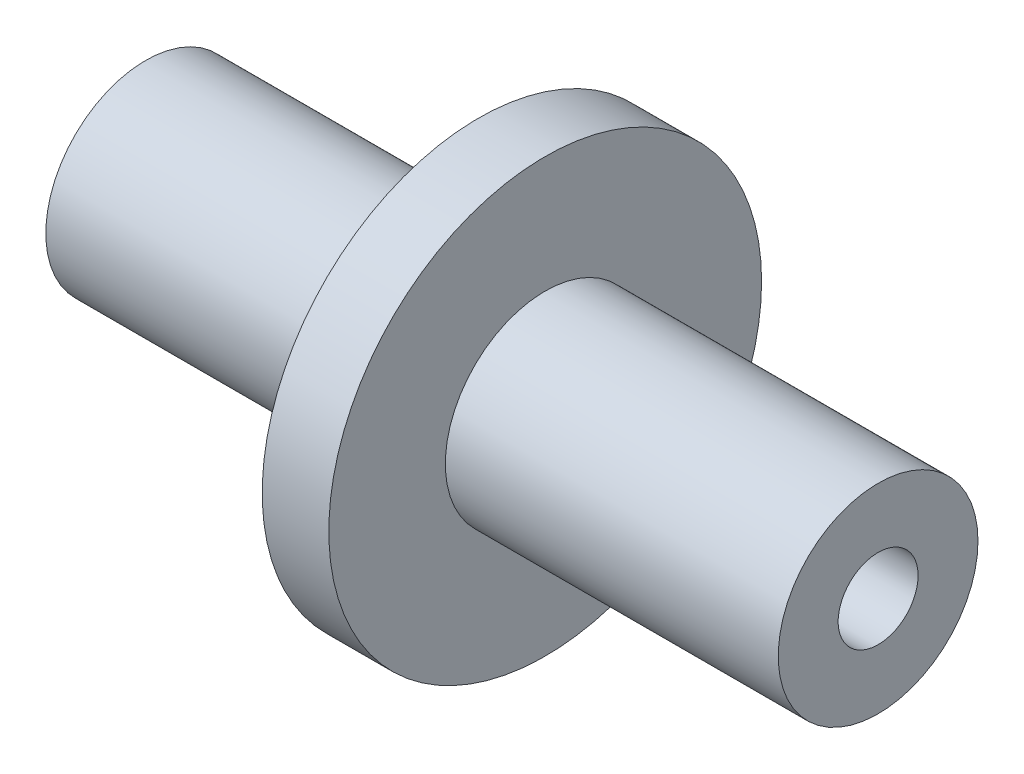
ISO-10303-21;
HEADER;
FILE_DESCRIPTION(('STEP AP214'),'2;1');
FILE_NAME('part.step','',(''),(''),'','','');
FILE_SCHEMA(('AUTOMOTIVE_DESIGN { 1 0 10303 214 1 1 1 1 }'));
ENDSEC;
DATA;
#1=APPLICATION_CONTEXT('core data for automotive mechanical design processes');
#2=APPLICATION_PROTOCOL_DEFINITION('international standard','automotive_design',2000,#1);
#3=PRODUCT_CONTEXT('',#1,'mechanical');
#4=PRODUCT('Part','Part','',(#3));
#5=PRODUCT_RELATED_PRODUCT_CATEGORY('part','',(#4));
#6=PRODUCT_DEFINITION_FORMATION('','',#4);
#7=PRODUCT_DEFINITION_CONTEXT('part definition',#1,'design');
#8=PRODUCT_DEFINITION('design','',#6,#7);
#9=PRODUCT_DEFINITION_SHAPE('','',#8);
#10=(LENGTH_UNIT() NAMED_UNIT(*) SI_UNIT(.MILLI.,.METRE.));
#11=(NAMED_UNIT(*) PLANE_ANGLE_UNIT() SI_UNIT($,.RADIAN.));
#12=(NAMED_UNIT(*) SI_UNIT($,.STERADIAN.) SOLID_ANGLE_UNIT());
#13=UNCERTAINTY_MEASURE_WITH_UNIT(LENGTH_MEASURE(1.E-05),#10,'distance_accuracy_value','');
#14=(GEOMETRIC_REPRESENTATION_CONTEXT(3) GLOBAL_UNCERTAINTY_ASSIGNED_CONTEXT((#13)) GLOBAL_UNIT_ASSIGNED_CONTEXT((#10,
#11,#12)) REPRESENTATION_CONTEXT('',''));
#15=CARTESIAN_POINT('',(0.,0.,0.));
#16=DIRECTION('',(0.,0.,1.));
#17=DIRECTION('',(1.,0.,0.));
#18=AXIS2_PLACEMENT_3D('',#15,#16,#17);
#19=CARTESIAN_POINT('',(-5.,0.,3.15));
#20=DIRECTION('',(1.,0.,0.));
#21=DIRECTION('',(0.,0.,-1.));
#22=AXIS2_PLACEMENT_3D('',#19,#20,#21);
#23=PLANE('',#22);
#24=CARTESIAN_POINT('',(-5.,0.,3.75));
#25=DIRECTION('',(1.,0.,0.));
#26=DIRECTION('',(0.,0.,-1.));
#27=AXIS2_PLACEMENT_3D('',#24,#25,#26);
#28=CIRCLE('',#27,1.5);
#29=CARTESIAN_POINT('',(-5.,0.,2.25));
#30=VERTEX_POINT('',#29);
#31=EDGE_CURVE('E10',#30,#30,#28,.T.);
#32=ORIENTED_EDGE('',*,*,#31,.T.);
#33=EDGE_LOOP('',(#32));
#34=FACE_BOUND('',#33,.T.);
#35=CARTESIAN_POINT('',(-5.,0.,3.75));
#36=DIRECTION('',(1.,0.,0.));
#37=DIRECTION('',(0.,0.,-1.));
#38=AXIS2_PLACEMENT_3D('',#35,#36,#37);
#39=CIRCLE('',#38,0.599999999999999);
#40=CARTESIAN_POINT('',(-5.,0.,3.15));
#41=VERTEX_POINT('',#40);
#42=EDGE_CURVE('E59',#41,#41,#39,.T.);
#43=ORIENTED_EDGE('',*,*,#42,.F.);
#44=EDGE_LOOP('',(#43));
#45=FACE_BOUND('',#44,.T.);
#46=ADVANCED_FACE('F31',(#34,#45),#23,.T.);
#47=CARTESIAN_POINT('',(4.60078378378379,0.,3.75));
#48=DIRECTION('',(1.,0.,0.));
#49=DIRECTION('',(0.,0.,-1.));
#50=AXIS2_PLACEMENT_3D('',#47,#48,#49);
#51=CYLINDRICAL_SURFACE('',#50,1.5);
#52=CARTESIAN_POINT('',(-10.,0.,3.75));
#53=DIRECTION('',(1.,0.,0.));
#54=DIRECTION('',(0.,0.,-1.));
#55=AXIS2_PLACEMENT_3D('',#52,#53,#54);
#56=CIRCLE('',#55,1.5);
#57=CARTESIAN_POINT('',(-10.,0.,2.25));
#58=VERTEX_POINT('',#57);
#59=EDGE_CURVE('E37',#58,#58,#56,.T.);
#60=ORIENTED_EDGE('',*,*,#59,.T.);
#61=EDGE_LOOP('',(#60));
#62=FACE_BOUND('',#61,.T.);
#63=ORIENTED_EDGE('',*,*,#31,.F.);
#64=EDGE_LOOP('',(#63));
#65=FACE_BOUND('',#64,.T.);
#66=ADVANCED_FACE('F67',(#62,#65),#51,.T.);
#67=CARTESIAN_POINT('',(-10.,0.,2.25));
#68=DIRECTION('',(1.,0.,0.));
#69=DIRECTION('',(0.,0.,-1.));
#70=AXIS2_PLACEMENT_3D('',#67,#68,#69);
#71=PLANE('',#70);
#72=CARTESIAN_POINT('',(-10.,0.,3.75));
#73=DIRECTION('',(1.,0.,0.));
#74=DIRECTION('',(0.,0.,-1.));
#75=AXIS2_PLACEMENT_3D('',#72,#73,#74);
#76=CIRCLE('',#75,3.25000000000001);
#77=CARTESIAN_POINT('',(-10.,0.,0.499999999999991));
#78=VERTEX_POINT('',#77);
#79=EDGE_CURVE('E41',#78,#78,#76,.T.);
#80=ORIENTED_EDGE('',*,*,#79,.T.);
#81=EDGE_LOOP('',(#80));
#82=FACE_BOUND('',#81,.T.);
#83=ORIENTED_EDGE('',*,*,#59,.F.);
#84=EDGE_LOOP('',(#83));
#85=FACE_BOUND('',#84,.T.);
#86=ADVANCED_FACE('F71',(#82,#85),#71,.T.);
#87=CARTESIAN_POINT('',(4.60078378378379,0.,3.75));
#88=DIRECTION('',(1.,0.,0.));
#89=DIRECTION('',(0.,0.,-1.));
#90=AXIS2_PLACEMENT_3D('',#87,#88,#89);
#91=CYLINDRICAL_SURFACE('',#90,3.25000000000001);
#92=CARTESIAN_POINT('',(-11.,0.,3.75));
#93=DIRECTION('',(1.,0.,0.));
#94=DIRECTION('',(0.,0.,-1.));
#95=AXIS2_PLACEMENT_3D('',#92,#93,#94);
#96=CIRCLE('',#95,3.25000000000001);
#97=CARTESIAN_POINT('',(-11.,0.,0.499999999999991));
#98=VERTEX_POINT('',#97);
#99=EDGE_CURVE('E45',#98,#98,#96,.T.);
#100=ORIENTED_EDGE('',*,*,#99,.T.);
#101=EDGE_LOOP('',(#100));
#102=FACE_BOUND('',#101,.T.);
#103=ORIENTED_EDGE('',*,*,#79,.F.);
#104=EDGE_LOOP('',(#103));
#105=FACE_BOUND('',#104,.T.);
#106=ADVANCED_FACE('F75',(#102,#105),#91,.T.);
#107=CARTESIAN_POINT('',(-11.,0.,0.499999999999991));
#108=DIRECTION('',(-1.,0.,0.));
#109=DIRECTION('',(0.,0.,1.));
#110=AXIS2_PLACEMENT_3D('',#107,#108,#109);
#111=PLANE('',#110);
#112=CARTESIAN_POINT('',(-11.,0.,3.75));
#113=DIRECTION('',(1.,0.,0.));
#114=DIRECTION('',(0.,0.,-1.));
#115=AXIS2_PLACEMENT_3D('',#112,#113,#114);
#116=CIRCLE('',#115,1.5);
#117=CARTESIAN_POINT('',(-11.,0.,2.25));
#118=VERTEX_POINT('',#117);
#119=EDGE_CURVE('E50',#118,#118,#116,.T.);
#120=ORIENTED_EDGE('',*,*,#119,.T.);
#121=EDGE_LOOP('',(#120));
#122=FACE_BOUND('',#121,.T.);
#123=ORIENTED_EDGE('',*,*,#99,.F.);
#124=EDGE_LOOP('',(#123));
#125=FACE_BOUND('',#124,.T.);
#126=ADVANCED_FACE('F82',(#122,#125),#111,.T.);
#127=CARTESIAN_POINT('',(4.60078378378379,0.,3.75));
#128=DIRECTION('',(1.,0.,0.));
#129=DIRECTION('',(0.,0.,-1.));
#130=AXIS2_PLACEMENT_3D('',#127,#128,#129);
#131=CYLINDRICAL_SURFACE('',#130,1.5);
#132=CARTESIAN_POINT('',(-16.,0.,3.75));
#133=DIRECTION('',(1.,0.,0.));
#134=DIRECTION('',(0.,0.,-1.));
#135=AXIS2_PLACEMENT_3D('',#132,#133,#134);
#136=CIRCLE('',#135,1.5);
#137=CARTESIAN_POINT('',(-16.,0.,2.25));
#138=VERTEX_POINT('',#137);
#139=EDGE_CURVE('E53',#138,#138,#136,.T.);
#140=ORIENTED_EDGE('',*,*,#139,.T.);
#141=EDGE_LOOP('',(#140));
#142=FACE_BOUND('',#141,.T.);
#143=ORIENTED_EDGE('',*,*,#119,.F.);
#144=EDGE_LOOP('',(#143));
#145=FACE_BOUND('',#144,.T.);
#146=ADVANCED_FACE('F86',(#142,#145),#131,.T.);
#147=CARTESIAN_POINT('',(-16.,0.,2.25));
#148=DIRECTION('',(-1.,0.,0.));
#149=DIRECTION('',(0.,0.,1.));
#150=AXIS2_PLACEMENT_3D('',#147,#148,#149);
#151=PLANE('',#150);
#152=CARTESIAN_POINT('',(-16.,0.,3.75));
#153=DIRECTION('',(1.,0.,0.));
#154=DIRECTION('',(0.,0.,-1.));
#155=AXIS2_PLACEMENT_3D('',#152,#153,#154);
#156=CIRCLE('',#155,0.6);
#157=CARTESIAN_POINT('',(-16.,0.,3.15));
#158=VERTEX_POINT('',#157);
#159=EDGE_CURVE('E56',#158,#158,#156,.T.);
#160=ORIENTED_EDGE('',*,*,#159,.T.);
#161=EDGE_LOOP('',(#160));
#162=FACE_BOUND('',#161,.T.);
#163=ORIENTED_EDGE('',*,*,#139,.F.);
#164=EDGE_LOOP('',(#163));
#165=FACE_BOUND('',#164,.T.);
#166=ADVANCED_FACE('F90',(#162,#165),#151,.T.);
#167=CARTESIAN_POINT('',(4.60078378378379,0.,3.75));
#168=DIRECTION('',(1.,0.,0.));
#169=DIRECTION('',(0.,0.,-1.));
#170=AXIS2_PLACEMENT_3D('',#167,#168,#169);
#171=CYLINDRICAL_SURFACE('',#170,0.599999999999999);
#172=ORIENTED_EDGE('',*,*,#42,.T.);
#173=EDGE_LOOP('',(#172));
#174=FACE_BOUND('',#173,.T.);
#175=ORIENTED_EDGE('',*,*,#159,.F.);
#176=EDGE_LOOP('',(#175));
#177=FACE_BOUND('',#176,.T.);
#178=ADVANCED_FACE('F63',(#174,#177),#171,.F.);
#179=CLOSED_SHELL('',(#46,#66,#86,#106,#126,#146,#166,#178));
#180=MANIFOLD_SOLID_BREP('B2',#179);
#181=ADVANCED_BREP_SHAPE_REPRESENTATION('',(#18,#180),#14);
#182=SHAPE_DEFINITION_REPRESENTATION(#9,#181);
ENDSEC;
END-ISO-10303-21;
